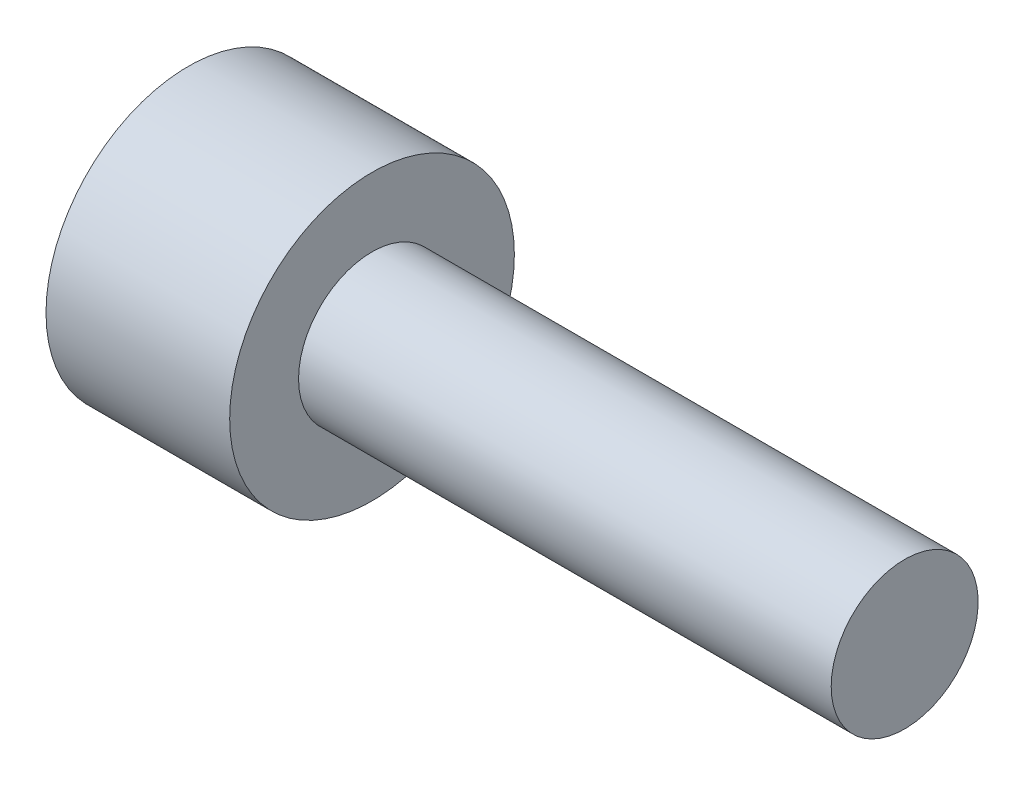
ISO-10303-21;
HEADER;
FILE_DESCRIPTION(('STEP AP214'),'2;1');
FILE_NAME('part.step','',(''),(''),'','','');
FILE_SCHEMA(('AUTOMOTIVE_DESIGN { 1 0 10303 214 1 1 1 1 }'));
ENDSEC;
DATA;
#1=APPLICATION_CONTEXT('core data for automotive mechanical design processes');
#2=APPLICATION_PROTOCOL_DEFINITION('international standard','automotive_design',2000,#1);
#3=PRODUCT_CONTEXT('',#1,'mechanical');
#4=PRODUCT('Part','Part','',(#3));
#5=PRODUCT_RELATED_PRODUCT_CATEGORY('part','',(#4));
#6=PRODUCT_DEFINITION_FORMATION('','',#4);
#7=PRODUCT_DEFINITION_CONTEXT('part definition',#1,'design');
#8=PRODUCT_DEFINITION('design','',#6,#7);
#9=PRODUCT_DEFINITION_SHAPE('','',#8);
#10=(LENGTH_UNIT() NAMED_UNIT(*) SI_UNIT(.MILLI.,.METRE.));
#11=(NAMED_UNIT(*) PLANE_ANGLE_UNIT() SI_UNIT($,.RADIAN.));
#12=(NAMED_UNIT(*) SI_UNIT($,.STERADIAN.) SOLID_ANGLE_UNIT());
#13=UNCERTAINTY_MEASURE_WITH_UNIT(LENGTH_MEASURE(1.E-05),#10,'distance_accuracy_value','');
#14=(GEOMETRIC_REPRESENTATION_CONTEXT(3) GLOBAL_UNCERTAINTY_ASSIGNED_CONTEXT((#13)) GLOBAL_UNIT_ASSIGNED_CONTEXT((#10,
#11,#12)) REPRESENTATION_CONTEXT('',''));
#15=CARTESIAN_POINT('',(0.,0.,0.));
#16=DIRECTION('',(0.,0.,1.));
#17=DIRECTION('',(1.,0.,0.));
#18=AXIS2_PLACEMENT_3D('',#15,#16,#17);
#19=CARTESIAN_POINT('',(0.,0.,0.));
#20=DIRECTION('',(1.,0.,0.));
#21=DIRECTION('',(0.,0.,-1.));
#22=AXIS2_PLACEMENT_3D('',#19,#20,#21);
#23=PLANE('',#22);
#24=CARTESIAN_POINT('',(0.,0.,0.));
#25=DIRECTION('',(-1.,0.,0.));
#26=DIRECTION('',(0.,0.,1.));
#27=AXIS2_PLACEMENT_3D('',#24,#25,#26);
#28=CIRCLE('',#27,0.15);
#29=CARTESIAN_POINT('',(0.,0.,0.15));
#30=VERTEX_POINT('',#29);
#31=EDGE_CURVE('E36',#30,#30,#28,.T.);
#32=ORIENTED_EDGE('',*,*,#31,.F.);
#33=EDGE_LOOP('',(#32));
#34=FACE_BOUND('',#33,.T.);
#35=CARTESIAN_POINT('',(0.,0.,0.));
#36=DIRECTION('',(-1.,0.,0.));
#37=DIRECTION('',(0.,0.,1.));
#38=AXIS2_PLACEMENT_3D('',#35,#36,#37);
#39=CIRCLE('',#38,1.55);
#40=CARTESIAN_POINT('',(0.,0.,1.55));
#41=VERTEX_POINT('',#40);
#42=EDGE_CURVE('E9',#41,#41,#39,.T.);
#43=ORIENTED_EDGE('',*,*,#42,.T.);
#44=EDGE_LOOP('',(#43));
#45=FACE_BOUND('',#44,.T.);
#46=ADVANCED_FACE('F14',(#34,#45),#23,.F.);
#47=CARTESIAN_POINT('',(0.,0.,0.));
#48=DIRECTION('',(-1.,0.,0.));
#49=DIRECTION('',(0.,0.,1.));
#50=AXIS2_PLACEMENT_3D('',#47,#48,#49);
#51=CYLINDRICAL_SURFACE('',#50,1.55);
#52=ORIENTED_EDGE('',*,*,#42,.F.);
#53=EDGE_LOOP('',(#52));
#54=FACE_BOUND('',#53,.T.);
#55=CARTESIAN_POINT('',(2.,0.,0.));
#56=DIRECTION('',(-1.,0.,0.));
#57=DIRECTION('',(0.,0.,1.));
#58=AXIS2_PLACEMENT_3D('',#55,#56,#57);
#59=CIRCLE('',#58,1.55);
#60=CARTESIAN_POINT('',(2.,0.,1.55));
#61=VERTEX_POINT('',#60);
#62=EDGE_CURVE('E20',#61,#61,#59,.T.);
#63=ORIENTED_EDGE('',*,*,#62,.T.);
#64=EDGE_LOOP('',(#63));
#65=FACE_BOUND('',#64,.T.);
#66=ADVANCED_FACE('F43',(#54,#65),#51,.T.);
#67=CARTESIAN_POINT('',(2.,1.55,0.));
#68=DIRECTION('',(-1.,0.,0.));
#69=DIRECTION('',(0.,0.,1.));
#70=AXIS2_PLACEMENT_3D('',#67,#68,#69);
#71=PLANE('',#70);
#72=ORIENTED_EDGE('',*,*,#62,.F.);
#73=EDGE_LOOP('',(#72));
#74=FACE_BOUND('',#73,.T.);
#75=CARTESIAN_POINT('',(2.,0.,0.));
#76=DIRECTION('',(-1.,0.,0.));
#77=DIRECTION('',(0.,0.,1.));
#78=AXIS2_PLACEMENT_3D('',#75,#76,#77);
#79=CIRCLE('',#78,0.8);
#80=CARTESIAN_POINT('',(2.,0.,0.8));
#81=VERTEX_POINT('',#80);
#82=EDGE_CURVE('E24',#81,#81,#79,.T.);
#83=ORIENTED_EDGE('',*,*,#82,.T.);
#84=EDGE_LOOP('',(#83));
#85=FACE_BOUND('',#84,.T.);
#86=ADVANCED_FACE('F49',(#74,#85),#71,.F.);
#87=CARTESIAN_POINT('',(0.,0.,0.));
#88=DIRECTION('',(-1.,0.,0.));
#89=DIRECTION('',(0.,0.,1.));
#90=AXIS2_PLACEMENT_3D('',#87,#88,#89);
#91=CYLINDRICAL_SURFACE('',#90,0.8);
#92=ORIENTED_EDGE('',*,*,#82,.F.);
#93=EDGE_LOOP('',(#92));
#94=FACE_BOUND('',#93,.T.);
#95=CARTESIAN_POINT('',(7.8,0.,0.));
#96=DIRECTION('',(-1.,0.,0.));
#97=DIRECTION('',(0.,0.,1.));
#98=AXIS2_PLACEMENT_3D('',#95,#96,#97);
#99=CIRCLE('',#98,0.8);
#100=CARTESIAN_POINT('',(7.8,0.,0.8));
#101=VERTEX_POINT('',#100);
#102=EDGE_CURVE('E28',#101,#101,#99,.T.);
#103=ORIENTED_EDGE('',*,*,#102,.T.);
#104=EDGE_LOOP('',(#103));
#105=FACE_BOUND('',#104,.T.);
#106=ADVANCED_FACE('F55',(#94,#105),#91,.T.);
#107=CARTESIAN_POINT('',(7.8,0.8,0.));
#108=DIRECTION('',(-1.,0.,0.));
#109=DIRECTION('',(0.,0.,1.));
#110=AXIS2_PLACEMENT_3D('',#107,#108,#109);
#111=PLANE('',#110);
#112=ORIENTED_EDGE('',*,*,#102,.F.);
#113=EDGE_LOOP('',(#112));
#114=FACE_BOUND('',#113,.T.);
#115=ADVANCED_FACE('F61',(#114),#111,.F.);
#116=CARTESIAN_POINT('',(0.,0.,0.));
#117=DIRECTION('',(-1.,0.,0.));
#118=DIRECTION('',(0.,0.,1.));
#119=AXIS2_PLACEMENT_3D('',#116,#117,#118);
#120=CONICAL_SURFACE('',#119,0.15,0.26179938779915);
#121=CARTESIAN_POINT('',(0.3,0.,0.));
#122=DIRECTION('',(-1.,0.,0.));
#123=DIRECTION('',(0.,0.,1.));
#124=AXIS2_PLACEMENT_3D('',#121,#122,#123);
#125=CIRCLE('',#124,0.069615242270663);
#126=CARTESIAN_POINT('',(0.3,0.,0.069615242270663));
#127=VERTEX_POINT('',#126);
#128=EDGE_CURVE('E33',#127,#127,#125,.T.);
#129=ORIENTED_EDGE('',*,*,#128,.F.);
#130=EDGE_LOOP('',(#129));
#131=FACE_BOUND('',#130,.T.);
#132=ORIENTED_EDGE('',*,*,#31,.T.);
#133=EDGE_LOOP('',(#132));
#134=FACE_BOUND('',#133,.T.);
#135=ADVANCED_FACE('F40',(#131,#134),#120,.F.);
#136=CARTESIAN_POINT('',(0.3,0.,0.));
#137=DIRECTION('',(-1.,0.,0.));
#138=DIRECTION('',(0.,0.,1.));
#139=AXIS2_PLACEMENT_3D('',#136,#137,#138);
#140=PLANE('',#139);
#141=ORIENTED_EDGE('',*,*,#128,.T.);
#142=EDGE_LOOP('',(#141));
#143=FACE_BOUND('',#142,.T.);
#144=ADVANCED_FACE('F68',(#143),#140,.T.);
#145=CLOSED_SHELL('',(#46,#66,#86,#106,#115,#135,#144));
#146=MANIFOLD_SOLID_BREP('B1',#145);
#147=ADVANCED_BREP_SHAPE_REPRESENTATION('',(#18,#146),#14);
#148=SHAPE_DEFINITION_REPRESENTATION(#9,#147);
ENDSEC;
END-ISO-10303-21;
